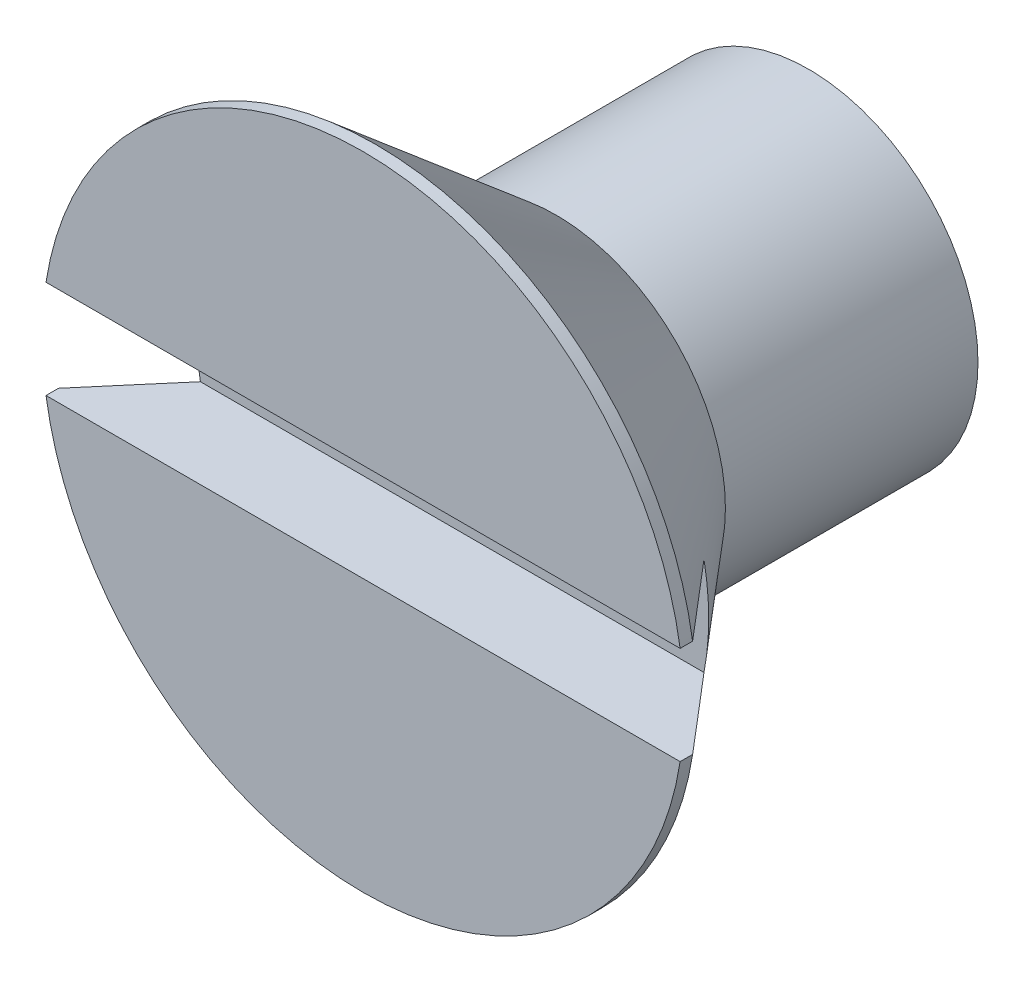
from build123d import *

# Parameters (mm, degrees)
SKETCH_2_W          = 1.27
SKETCH_2_H          = 1.397
CUT_EXTRUDE_1_DEPTH = 5.08


with BuildPart() as part:
    # Sketch 1 → Revolve 1 (revolve)
    with BuildSketch(Plane(origin=(0, 0, 0), x_dir=(0, 0, -1), z_dir=(1, 0, 0)), mode=Mode.PRIVATE) as revolve_1_sk:
        Polygon((0, 0), (0, 4.572), (0.1778, 4.572), (2.750796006, 2.413), (5.112988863, 2.413), (6.35, 2.413), (6.35, 0), align=None)
    revolve(revolve_1_sk.sketch.rotate(Axis((0, 0, 12.973418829), (0, 0, -1)), 90), axis=Axis((0, 0, 12.973418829), (0, 0, -1)))

    # Sketch 2 → Cut-Extrude 1 (cut, symmetric)
    with BuildSketch(Plane(origin=(0, 0, 0), x_dir=(0, 0, -1), z_dir=(1, 0, 0))):
        with Locations((0.635, 0)):
            Rectangle(SKETCH_2_W, SKETCH_2_H)
    extrude(amount=CUT_EXTRUDE_1_DEPTH, both=True, mode=Mode.SUBTRACT)


solid = part.part
